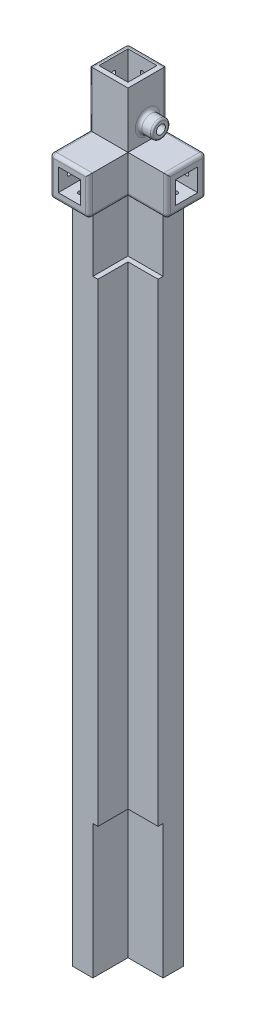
from build123d import *

# Parameters (mm, degrees)
BOSS_EXTRUDE1_DEPTH = 35
SKETCH8_W           = 35
SKETCH8_H           = 35
BOSS_EXTRUDE2_DEPTH = 35
SKETCH9_W           = 20
SKETCH9_H           = 20
CUT_EXTRUDE1_DEPTH  = 20
SKETCH4_W           = 20
SKETCH4_H           = 20
CUT_EXTRUDE2_DEPTH  = 20
SKETCH10_R          = 8
BOSS_EXTRUDE3_DEPTH = 12
SKETCH11_R          = 4
CUT_EXTRUDE3_DEPTH  = 25
SKETCH5_W           = 26
SKETCH5_H           = 26
CUT_EXTRUDE4_DEPTH  = 25
SKETCH12_R          = 2
CUT_EXTRUDE5_DEPTH  = 10
SKETCH13_R          = 2
CUT_EXTRUDE6_DEPTH  = 10
SKETCH14_R          = 2
CUT_EXTRUDE7_DEPTH  = 10
FILLET1_R           = 3
FILLET2_R           = 3
FILLET3_R           = 1.5
BOSS_EXTRUDE4_DEPTH = 630
SKETCH16_W          = 4.5
SKETCH16_H          = 85
CUT_EXTRUDE8_DEPTH  = 27
SKETCH17_W          = 4.5
SKETCH17_H          = 85
CUT_EXTRUDE9_DEPTH  = 31.5
SKETCH18_W          = 4.5
SKETCH18_H          = 120
CUT_EXTRUDE10_DEPTH = 27
SKETCH19_W          = 4.5
SKETCH19_H          = 120
CUT_EXTRUDE11_DEPTH = 31.5


with BuildPart() as part:
    # Sketch1 → Boss-Extrude1 (new body)
    with BuildSketch(Plane.XY):
        Polygon((0, 85), (0, 0), (70, 0), (70, 35), (35, 35), (35, 85), align=None)
    extrude(amount=BOSS_EXTRUDE1_DEPTH)

    # Sketch8 → Boss-Extrude2 (add)
    with BuildSketch(Plane.XY.offset(35)):
        with Locations((17.5, 17.5)):
            Rectangle(SKETCH8_W, SKETCH8_H)
    extrude(amount=BOSS_EXTRUDE2_DEPTH)

    # Sketch9 → Cut-Extrude1 (cut)
    with BuildSketch(Plane.XY.offset(70)):
        with Locations((17.5, 17.5)):
            Rectangle(SKETCH9_W, SKETCH9_H)
    extrude(amount=-CUT_EXTRUDE1_DEPTH, mode=Mode.SUBTRACT)

    # Sketch4 → Cut-Extrude2 (cut)
    with BuildSketch(Plane(origin=(70, 0, 0), x_dir=(0, 0, -1), z_dir=(1, 0, 0))):
        with Locations((-17.5, 17.5)):
            Rectangle(SKETCH4_W, SKETCH4_H)
    extrude(amount=-CUT_EXTRUDE2_DEPTH, mode=Mode.SUBTRACT)

    # Sketch10 → Boss-Extrude3 (add)
    with BuildSketch(Plane(origin=(35, 0, 0), x_dir=(0, 0, -1), z_dir=(1, 0, 0))):
        with Locations(Location((-17.5, 50, 0), (0, 0, 180))):
            Circle(SKETCH10_R)
    extrude(amount=BOSS_EXTRUDE3_DEPTH)

    # Sketch11 → Cut-Extrude3 (cut)
    with BuildSketch(Plane(origin=(47, 0, 0), x_dir=(0, 0, -1), z_dir=(1, 0, 0))):
        with Locations((-17.5, 50)):
            Circle(SKETCH11_R)
    extrude(amount=-CUT_EXTRUDE3_DEPTH, mode=Mode.SUBTRACT)

    # Sketch5 → Cut-Extrude4 (cut)
    with BuildSketch(Plane(origin=(0, 85, 0), x_dir=(1, 0, 0), z_dir=(0, 1, 0))):
        with Locations((17.5, -17.5)):
            Rectangle(SKETCH5_W, SKETCH5_H)
    extrude(amount=-CUT_EXTRUDE4_DEPTH, mode=Mode.SUBTRACT)

    # Sketch12 → Cut-Extrude5 (cut)
    with BuildSketch(Plane.ZY):
        with Locations(Location((17.5, 72.5, 0), (0, 0, 270))):
            Circle(SKETCH12_R)
        with Locations(Location((60, 17.5, 0), (0, 0, 270))):
            Circle(SKETCH12_R)
    extrude(amount=-CUT_EXTRUDE5_DEPTH, mode=Mode.SUBTRACT)

    # Sketch13 → Cut-Extrude6 (cut)
    with BuildSketch(Plane(origin=(0, 0, 0), x_dir=(-1, 0, 0), z_dir=(0, 0, -1))):
        with Locations((-17.5, 72.5)):
            Circle(SKETCH13_R)
        with Locations((-60, 17.5)):
            Circle(SKETCH13_R)
    extrude(amount=-CUT_EXTRUDE6_DEPTH, mode=Mode.SUBTRACT)

    # Sketch14 → Cut-Extrude7 (cut)
    with BuildSketch(Plane.XZ):
        with Locations(Location((17.5, 60, 0), (0, 0, 270))):
            Circle(SKETCH14_R)
        with Locations(Location((60, 17.5, 0), (0, 0, 270))):
            Circle(SKETCH14_R)
    extrude(amount=-CUT_EXTRUDE7_DEPTH, mode=Mode.SUBTRACT)

    # Fillet1
    fillet1_edges = [part.edges().sort_by_distance(p)[0] for p in [
        (70, 35, 17.5),
        (70, 0, 17.5),
        (0, 0, 35),
        (0, 85, 17.5),
        (70, 17.5, 35),
        (52.5, 0, 35),
        (0, 35, 52.5),
        (35, 0, 52.5),
        (0, 17.5, 70),
        (17.5, 0, 70),
        (35, 17.5, 70),
        (17.5, 35, 70),
        (35, 60, 0),
        (52.5, 35, 0),
        (70, 17.5, 0),
        (35, 0, 0),
        (0, 42.5, 0),
        (17.5, 85, 0),
        (0, 60, 35),
    ]]
    fillet(fillet1_edges, radius=FILLET1_R)

    # Fillet2
    fillet2_edges = [part.edges().sort_by_distance(p)[0] for p in [
        (35, 50, 9.5),
    ]]
    fillet(fillet2_edges, radius=FILLET2_R)

    # Fillet3
    fillet3_edges = [part.edges().sort_by_distance(p)[0] for p in [
        (47, 50, 9.5),
    ]]
    fillet(fillet3_edges, radius=FILLET3_R)


with BuildPart() as body_2:
    # Sketch15 → Boss-Extrude4 (new body)
    with BuildSketch(Plane.XZ):
        with BuildLine():
            Line((-23, 27), (-23, 0))
            ThreePointArc((-23, 0), (-16.263455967, -16.263455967), (0, -23))
            Line((0, -23), (27, -23))
            Line((27, -23), (27, 0))
            Line((27, 0), (0, 0))
            Line((0, 0), (0, 27))
            Line((0, 27), (-23, 27))
        make_face()
    extrude(amount=BOSS_EXTRUDE4_DEPTH)

    # Sketch16 → Cut-Extrude8 (cut)
    with BuildSketch(Plane.XY.offset(27)):
        with Locations((-2.25, -42.5)):
            Rectangle(SKETCH16_W, SKETCH16_H)
    extrude(amount=-CUT_EXTRUDE8_DEPTH, mode=Mode.SUBTRACT)

    # Sketch17 → Cut-Extrude9 (cut)
    with BuildSketch(Plane(origin=(27, 0, 0), x_dir=(0, 0, -1), z_dir=(1, 0, 0))):
        with Locations((2.25, -42.5)):
            Rectangle(SKETCH17_W, SKETCH17_H)
    extrude(amount=-CUT_EXTRUDE9_DEPTH, mode=Mode.SUBTRACT)

    # Sketch18 → Cut-Extrude10 (cut)
    with BuildSketch(Plane(origin=(27, 0, 0), x_dir=(0, 0, -1), z_dir=(1, 0, 0))):
        with Locations((2.25, -570)):
            Rectangle(SKETCH18_W, SKETCH18_H)
    extrude(amount=-CUT_EXTRUDE10_DEPTH, mode=Mode.SUBTRACT)

    # Sketch19 → Cut-Extrude11 (cut)
    with BuildSketch(Plane.XY.offset(27)):
        with Locations((-2.25, -570)):
            Rectangle(SKETCH19_W, SKETCH19_H)
    extrude(amount=-CUT_EXTRUDE11_DEPTH, mode=Mode.SUBTRACT)


solid = Compound([part.part, body_2.part])
